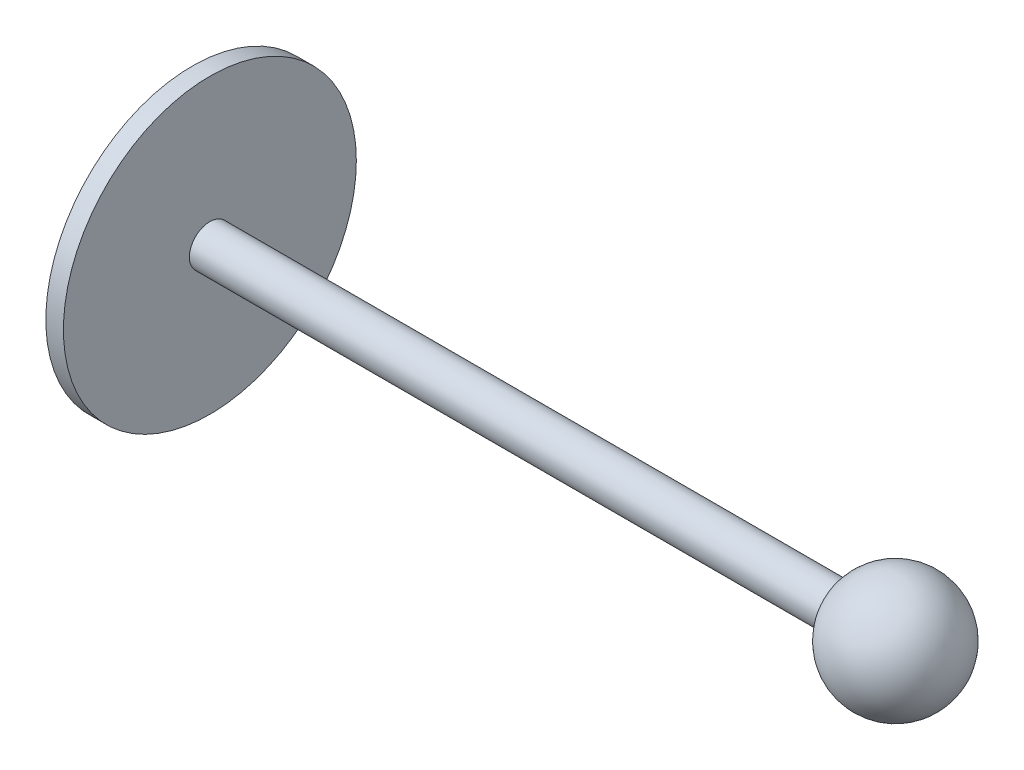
ISO-10303-21;
HEADER;
FILE_DESCRIPTION(('STEP AP214'),'2;1');
FILE_NAME('part.step','',(''),(''),'','','');
FILE_SCHEMA(('AUTOMOTIVE_DESIGN { 1 0 10303 214 1 1 1 1 }'));
ENDSEC;
DATA;
#1=APPLICATION_CONTEXT('core data for automotive mechanical design processes');
#2=APPLICATION_PROTOCOL_DEFINITION('international standard','automotive_design',2000,#1);
#3=PRODUCT_CONTEXT('',#1,'mechanical');
#4=PRODUCT('Part','Part','',(#3));
#5=PRODUCT_RELATED_PRODUCT_CATEGORY('part','',(#4));
#6=PRODUCT_DEFINITION_FORMATION('','',#4);
#7=PRODUCT_DEFINITION_CONTEXT('part definition',#1,'design');
#8=PRODUCT_DEFINITION('design','',#6,#7);
#9=PRODUCT_DEFINITION_SHAPE('','',#8);
#10=(LENGTH_UNIT() NAMED_UNIT(*) SI_UNIT(.MILLI.,.METRE.));
#11=(NAMED_UNIT(*) PLANE_ANGLE_UNIT() SI_UNIT($,.RADIAN.));
#12=(NAMED_UNIT(*) SI_UNIT($,.STERADIAN.) SOLID_ANGLE_UNIT());
#13=UNCERTAINTY_MEASURE_WITH_UNIT(LENGTH_MEASURE(1.E-05),#10,'distance_accuracy_value','');
#14=(GEOMETRIC_REPRESENTATION_CONTEXT(3) GLOBAL_UNCERTAINTY_ASSIGNED_CONTEXT((#13)) GLOBAL_UNIT_ASSIGNED_CONTEXT((#10,
#11,#12)) REPRESENTATION_CONTEXT('',''));
#15=CARTESIAN_POINT('',(0.,0.,0.));
#16=DIRECTION('',(0.,0.,1.));
#17=DIRECTION('',(1.,0.,0.));
#18=AXIS2_PLACEMENT_3D('',#15,#16,#17);
#19=CARTESIAN_POINT('',(0.,0.,0.));
#20=DIRECTION('',(1.,0.,0.));
#21=DIRECTION('',(0.,1.,0.));
#22=AXIS2_PLACEMENT_3D('',#19,#20,#21);
#23=SPHERICAL_SURFACE('',#22,10.);
#24=CARTESIAN_POINT('',(-9.3674969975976,0.,0.));
#25=DIRECTION('',(1.,0.,0.));
#26=DIRECTION('',(0.,0.,-1.));
#27=AXIS2_PLACEMENT_3D('',#24,#25,#26);
#28=CIRCLE('',#27,3.49999999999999);
#29=CARTESIAN_POINT('',(-9.3674969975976,0.,-3.49999999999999));
#30=VERTEX_POINT('',#29);
#31=EDGE_CURVE('E10',#30,#30,#28,.T.);
#32=ORIENTED_EDGE('',*,*,#31,.T.);
#33=EDGE_LOOP('',(#32));
#34=FACE_BOUND('',#33,.T.);
#35=ADVANCED_FACE('F30',(#34),#23,.T.);
#36=CARTESIAN_POINT('',(38.7384344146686,0.,0.));
#37=DIRECTION('',(1.,0.,0.));
#38=DIRECTION('',(0.,0.,-1.));
#39=AXIS2_PLACEMENT_3D('',#36,#37,#38);
#40=CYLINDRICAL_SURFACE('',#39,3.49999999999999);
#41=CARTESIAN_POINT('',(-117.,0.,0.));
#42=DIRECTION('',(1.,0.,0.));
#43=DIRECTION('',(0.,0.,-1.));
#44=AXIS2_PLACEMENT_3D('',#41,#42,#43);
#45=CIRCLE('',#44,3.49999999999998);
#46=CARTESIAN_POINT('',(-117.,0.,-3.49999999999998));
#47=VERTEX_POINT('',#46);
#48=EDGE_CURVE('E36',#47,#47,#45,.T.);
#49=ORIENTED_EDGE('',*,*,#48,.T.);
#50=EDGE_LOOP('',(#49));
#51=FACE_BOUND('',#50,.T.);
#52=ORIENTED_EDGE('',*,*,#31,.F.);
#53=EDGE_LOOP('',(#52));
#54=FACE_BOUND('',#53,.T.);
#55=ADVANCED_FACE('F62',(#51,#54),#40,.T.);
#56=CARTESIAN_POINT('',(-117.,3.49999999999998,0.));
#57=DIRECTION('',(1.,0.,0.));
#58=DIRECTION('',(0.,0.,-1.));
#59=AXIS2_PLACEMENT_3D('',#56,#57,#58);
#60=PLANE('',#59);
#61=CARTESIAN_POINT('',(-117.,0.,0.));
#62=DIRECTION('',(1.,0.,0.));
#63=DIRECTION('',(0.,0.,-1.));
#64=AXIS2_PLACEMENT_3D('',#61,#62,#63);
#65=CIRCLE('',#64,25.);
#66=CARTESIAN_POINT('',(-117.,0.,-25.));
#67=VERTEX_POINT('',#66);
#68=EDGE_CURVE('E40',#67,#67,#65,.T.);
#69=ORIENTED_EDGE('',*,*,#68,.T.);
#70=EDGE_LOOP('',(#69));
#71=FACE_BOUND('',#70,.T.);
#72=ORIENTED_EDGE('',*,*,#48,.F.);
#73=EDGE_LOOP('',(#72));
#74=FACE_BOUND('',#73,.T.);
#75=ADVANCED_FACE('F59',(#71,#74),#60,.T.);
#76=CARTESIAN_POINT('',(38.7384344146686,0.,0.));
#77=DIRECTION('',(1.,0.,0.));
#78=DIRECTION('',(0.,0.,-1.));
#79=AXIS2_PLACEMENT_3D('',#76,#77,#78);
#80=CYLINDRICAL_SURFACE('',#79,25.);
#81=CARTESIAN_POINT('',(-120.,0.,0.));
#82=DIRECTION('',(1.,0.,0.));
#83=DIRECTION('',(0.,0.,-1.));
#84=AXIS2_PLACEMENT_3D('',#81,#82,#83);
#85=CIRCLE('',#84,25.);
#86=CARTESIAN_POINT('',(-120.,0.,-25.));
#87=VERTEX_POINT('',#86);
#88=EDGE_CURVE('E44',#87,#87,#85,.T.);
#89=ORIENTED_EDGE('',*,*,#88,.T.);
#90=EDGE_LOOP('',(#89));
#91=FACE_BOUND('',#90,.T.);
#92=ORIENTED_EDGE('',*,*,#68,.F.);
#93=EDGE_LOOP('',(#92));
#94=FACE_BOUND('',#93,.T.);
#95=ADVANCED_FACE('F50',(#91,#94),#80,.T.);
#96=CARTESIAN_POINT('',(-120.,25.,0.));
#97=DIRECTION('',(-1.,0.,0.));
#98=DIRECTION('',(0.,0.,1.));
#99=AXIS2_PLACEMENT_3D('',#96,#97,#98);
#100=PLANE('',#99);
#101=ORIENTED_EDGE('',*,*,#88,.F.);
#102=EDGE_LOOP('',(#101));
#103=FACE_BOUND('',#102,.T.);
#104=ADVANCED_FACE('F53',(#103),#100,.T.);
#105=CLOSED_SHELL('',(#35,#55,#75,#95,#104));
#106=MANIFOLD_SOLID_BREP('B2',#105);
#107=ADVANCED_BREP_SHAPE_REPRESENTATION('',(#18,#106),#14);
#108=SHAPE_DEFINITION_REPRESENTATION(#9,#107);
ENDSEC;
END-ISO-10303-21;
